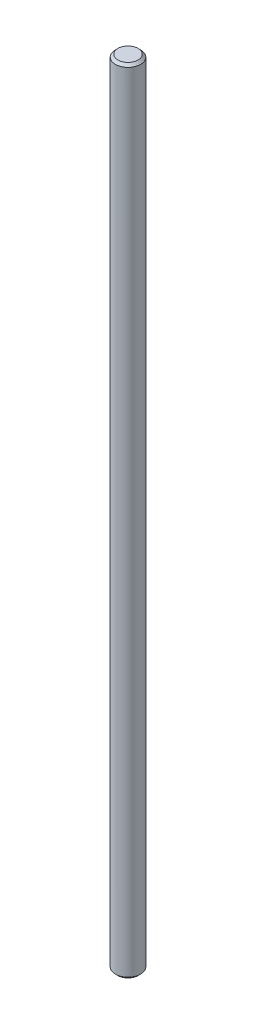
ISO-10303-21;
HEADER;
FILE_DESCRIPTION(('STEP AP214'),'2;1');
FILE_NAME('part.step','',(''),(''),'','','');
FILE_SCHEMA(('AUTOMOTIVE_DESIGN { 1 0 10303 214 1 1 1 1 }'));
ENDSEC;
DATA;
#1=APPLICATION_CONTEXT('core data for automotive mechanical design processes');
#2=APPLICATION_PROTOCOL_DEFINITION('international standard','automotive_design',2000,#1);
#3=PRODUCT_CONTEXT('',#1,'mechanical');
#4=PRODUCT('Part','Part','',(#3));
#5=PRODUCT_RELATED_PRODUCT_CATEGORY('part','',(#4));
#6=PRODUCT_DEFINITION_FORMATION('','',#4);
#7=PRODUCT_DEFINITION_CONTEXT('part definition',#1,'design');
#8=PRODUCT_DEFINITION('design','',#6,#7);
#9=PRODUCT_DEFINITION_SHAPE('','',#8);
#10=(LENGTH_UNIT() NAMED_UNIT(*) SI_UNIT(.MILLI.,.METRE.));
#11=(NAMED_UNIT(*) PLANE_ANGLE_UNIT() SI_UNIT($,.RADIAN.));
#12=(NAMED_UNIT(*) SI_UNIT($,.STERADIAN.) SOLID_ANGLE_UNIT());
#13=UNCERTAINTY_MEASURE_WITH_UNIT(LENGTH_MEASURE(1.E-05),#10,'distance_accuracy_value','');
#14=(GEOMETRIC_REPRESENTATION_CONTEXT(3) GLOBAL_UNCERTAINTY_ASSIGNED_CONTEXT((#13)) GLOBAL_UNIT_ASSIGNED_CONTEXT((#10,
#11,#12)) REPRESENTATION_CONTEXT('',''));
#15=CARTESIAN_POINT('',(0.,0.,0.));
#16=DIRECTION('',(0.,0.,1.));
#17=DIRECTION('',(1.,0.,0.));
#18=AXIS2_PLACEMENT_3D('',#15,#16,#17);
#19=CARTESIAN_POINT('',(0.,126.,0.));
#20=DIRECTION('',(0.,-1.,0.));
#21=DIRECTION('',(0.,0.,-1.));
#22=AXIS2_PLACEMENT_3D('',#19,#20,#21);
#23=CYLINDRICAL_SURFACE('',#22,2.);
#24=CARTESIAN_POINT('',(0.,0.399999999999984,0.));
#25=DIRECTION('',(0.,1.,0.));
#26=DIRECTION('',(0.,0.,1.));
#27=AXIS2_PLACEMENT_3D('',#24,#25,#26);
#28=CIRCLE('',#27,2.);
#29=CARTESIAN_POINT('',(0.,0.399999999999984,2.));
#30=VERTEX_POINT('',#29);
#31=EDGE_CURVE('E39',#30,#30,#28,.T.);
#32=ORIENTED_EDGE('',*,*,#31,.T.);
#33=EDGE_LOOP('',(#32));
#34=FACE_BOUND('',#33,.T.);
#35=CARTESIAN_POINT('',(0.,125.6,0.));
#36=DIRECTION('',(0.,1.,0.));
#37=DIRECTION('',(0.,0.,1.));
#38=AXIS2_PLACEMENT_3D('',#35,#36,#37);
#39=CIRCLE('',#38,2.);
#40=CARTESIAN_POINT('',(0.,125.6,-2.00000000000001));
#41=VERTEX_POINT('',#40);
#42=EDGE_CURVE('E43',#41,#41,#39,.F.);
#43=ORIENTED_EDGE('',*,*,#42,.T.);
#44=EDGE_LOOP('',(#43));
#45=FACE_BOUND('',#44,.T.);
#46=ADVANCED_FACE('F28',(#34,#45),#23,.T.);
#47=CARTESIAN_POINT('',(0.,126.,0.));
#48=DIRECTION('',(0.,1.,0.));
#49=DIRECTION('',(0.,0.,1.));
#50=AXIS2_PLACEMENT_3D('',#47,#48,#49);
#51=PLANE('',#50);
#52=CARTESIAN_POINT('',(0.,126.,0.));
#53=DIRECTION('',(0.,1.,0.));
#54=DIRECTION('',(0.,0.,1.));
#55=AXIS2_PLACEMENT_3D('',#52,#53,#54);
#56=CIRCLE('',#55,1.60000000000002);
#57=CARTESIAN_POINT('',(0.,126.,-1.60000000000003));
#58=VERTEX_POINT('',#57);
#59=EDGE_CURVE('E10',#58,#58,#56,.T.);
#60=ORIENTED_EDGE('',*,*,#59,.T.);
#61=EDGE_LOOP('',(#60));
#62=FACE_BOUND('',#61,.T.);
#63=ADVANCED_FACE('F59',(#62),#51,.T.);
#64=CARTESIAN_POINT('',(0.,0.,0.));
#65=DIRECTION('',(0.,1.,0.));
#66=DIRECTION('',(0.,0.,1.));
#67=AXIS2_PLACEMENT_3D('',#64,#65,#66);
#68=PLANE('',#67);
#69=CARTESIAN_POINT('',(0.,0.,0.));
#70=DIRECTION('',(0.,1.,0.));
#71=DIRECTION('',(0.,0.,1.));
#72=AXIS2_PLACEMENT_3D('',#69,#70,#71);
#73=CIRCLE('',#72,1.60000000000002);
#74=CARTESIAN_POINT('',(0.,0.,1.60000000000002));
#75=VERTEX_POINT('',#74);
#76=EDGE_CURVE('E35',#75,#75,#73,.F.);
#77=ORIENTED_EDGE('',*,*,#76,.T.);
#78=EDGE_LOOP('',(#77));
#79=FACE_BOUND('',#78,.T.);
#80=ADVANCED_FACE('F56',(#79),#68,.F.);
#81=CARTESIAN_POINT('',(0.,0.399999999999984,0.));
#82=DIRECTION('',(0.,1.,0.));
#83=DIRECTION('',(0.,0.,1.));
#84=AXIS2_PLACEMENT_3D('',#81,#82,#83);
#85=CONICAL_SURFACE('',#84,2.,0.785398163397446);
#86=ORIENTED_EDGE('',*,*,#76,.F.);
#87=EDGE_LOOP('',(#86));
#88=FACE_BOUND('',#87,.T.);
#89=ORIENTED_EDGE('',*,*,#31,.F.);
#90=EDGE_LOOP('',(#89));
#91=FACE_BOUND('',#90,.T.);
#92=ADVANCED_FACE('F52',(#88,#91),#85,.T.);
#93=CARTESIAN_POINT('',(0.,126.,0.));
#94=DIRECTION('',(0.,-1.,0.));
#95=DIRECTION('',(0.,0.,-1.));
#96=AXIS2_PLACEMENT_3D('',#93,#94,#95);
#97=CONICAL_SURFACE('',#96,1.60000000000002,0.785398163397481);
#98=CARTESIAN_POINT('',(0.,125.6,-2.00000000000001));
#99=CARTESIAN_POINT('',(0.,125.604166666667,-1.99583333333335));
#100=CARTESIAN_POINT('',(0.,125.608333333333,-1.99166666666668));
#101=CARTESIAN_POINT('',(0.,125.616666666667,-1.98333333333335));
#102=CARTESIAN_POINT('',(0.,125.620833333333,-1.97916666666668));
#103=CARTESIAN_POINT('',(0.,125.629166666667,-1.97083333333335));
#104=CARTESIAN_POINT('',(0.,125.633333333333,-1.96666666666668));
#105=CARTESIAN_POINT('',(0.,125.641666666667,-1.95833333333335));
#106=CARTESIAN_POINT('',(0.,125.645833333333,-1.95416666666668));
#107=CARTESIAN_POINT('',(0.,125.654166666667,-1.94583333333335));
#108=CARTESIAN_POINT('',(0.,125.658333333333,-1.94166666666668));
#109=CARTESIAN_POINT('',(0.,125.666666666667,-1.93333333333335));
#110=CARTESIAN_POINT('',(0.,125.670833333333,-1.92916666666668));
#111=CARTESIAN_POINT('',(0.,125.679166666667,-1.92083333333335));
#112=CARTESIAN_POINT('',(0.,125.683333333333,-1.91666666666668));
#113=CARTESIAN_POINT('',(0.,125.691666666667,-1.90833333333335));
#114=CARTESIAN_POINT('',(0.,125.695833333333,-1.90416666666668));
#115=CARTESIAN_POINT('',(0.,125.704166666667,-1.89583333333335));
#116=CARTESIAN_POINT('',(0.,125.708333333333,-1.89166666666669));
#117=CARTESIAN_POINT('',(0.,125.716666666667,-1.88333333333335));
#118=CARTESIAN_POINT('',(0.,125.720833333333,-1.87916666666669));
#119=CARTESIAN_POINT('',(0.,125.729166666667,-1.87083333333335));
#120=CARTESIAN_POINT('',(0.,125.733333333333,-1.86666666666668));
#121=CARTESIAN_POINT('',(0.,125.741666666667,-1.85833333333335));
#122=CARTESIAN_POINT('',(0.,125.745833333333,-1.85416666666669));
#123=CARTESIAN_POINT('',(0.,125.754166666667,-1.84583333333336));
#124=CARTESIAN_POINT('',(0.,125.758333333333,-1.84166666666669));
#125=CARTESIAN_POINT('',(0.,125.766666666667,-1.83333333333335));
#126=CARTESIAN_POINT('',(0.,125.770833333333,-1.82916666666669));
#127=CARTESIAN_POINT('',(0.,125.779166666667,-1.82083333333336));
#128=CARTESIAN_POINT('',(0.,125.783333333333,-1.81666666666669));
#129=CARTESIAN_POINT('',(0.,125.791666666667,-1.80833333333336));
#130=CARTESIAN_POINT('',(0.,125.795833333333,-1.80416666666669));
#131=CARTESIAN_POINT('',(0.,125.804166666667,-1.79583333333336));
#132=CARTESIAN_POINT('',(0.,125.808333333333,-1.79166666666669));
#133=CARTESIAN_POINT('',(0.,125.816666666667,-1.78333333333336));
#134=CARTESIAN_POINT('',(0.,125.820833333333,-1.77916666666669));
#135=CARTESIAN_POINT('',(0.,125.829166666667,-1.77083333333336));
#136=CARTESIAN_POINT('',(0.,125.833333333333,-1.76666666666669));
#137=CARTESIAN_POINT('',(0.,125.841666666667,-1.75833333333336));
#138=CARTESIAN_POINT('',(0.,125.845833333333,-1.75416666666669));
#139=CARTESIAN_POINT('',(0.,125.854166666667,-1.74583333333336));
#140=CARTESIAN_POINT('',(0.,125.858333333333,-1.74166666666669));
#141=CARTESIAN_POINT('',(0.,125.866666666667,-1.73333333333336));
#142=CARTESIAN_POINT('',(0.,125.870833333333,-1.72916666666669));
#143=CARTESIAN_POINT('',(0.,125.879166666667,-1.72083333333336));
#144=CARTESIAN_POINT('',(0.,125.883333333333,-1.71666666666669));
#145=CARTESIAN_POINT('',(0.,125.891666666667,-1.70833333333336));
#146=CARTESIAN_POINT('',(0.,125.895833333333,-1.7041666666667));
#147=CARTESIAN_POINT('',(0.,125.904166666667,-1.69583333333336));
#148=CARTESIAN_POINT('',(0.,125.908333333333,-1.6916666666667));
#149=CARTESIAN_POINT('',(0.,125.916666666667,-1.68333333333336));
#150=CARTESIAN_POINT('',(0.,125.920833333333,-1.67916666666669));
#151=CARTESIAN_POINT('',(0.,125.929166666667,-1.67083333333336));
#152=CARTESIAN_POINT('',(0.,125.933333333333,-1.6666666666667));
#153=CARTESIAN_POINT('',(0.,125.941666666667,-1.65833333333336));
#154=CARTESIAN_POINT('',(0.,125.945833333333,-1.6541666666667));
#155=CARTESIAN_POINT('',(0.,125.954166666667,-1.64583333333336));
#156=CARTESIAN_POINT('',(0.,125.958333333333,-1.6416666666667));
#157=CARTESIAN_POINT('',(0.,125.966666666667,-1.63333333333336));
#158=CARTESIAN_POINT('',(0.,125.970833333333,-1.6291666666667));
#159=CARTESIAN_POINT('',(0.,125.979166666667,-1.62083333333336));
#160=CARTESIAN_POINT('',(0.,125.983333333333,-1.6166666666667));
#161=CARTESIAN_POINT('',(0.,125.991666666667,-1.60833333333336));
#162=CARTESIAN_POINT('',(0.,125.995833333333,-1.6041666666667));
#163=CARTESIAN_POINT('',(0.,126.,-1.60000000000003));
#164=B_SPLINE_CURVE_WITH_KNOTS('',3,(#98,#99,#100,#101,#102,#103,#104,#105,#106,#107,#108,#109,
#110,#111,#112,#113,#114,#115,#116,#117,#118,#119,#120,#121,#122,#123,#124,#125,#126,#127,#128,
#129,#130,#131,#132,#133,#134,#135,#136,#137,#138,#139,#140,#141,#142,#143,#144,#145,#146,#147,
#148,#149,#150,#151,#152,#153,#154,#155,#156,#157,#158,#159,#160,#161,#162,#163),.UNSPECIFIED.,
.F.,.F.,(4,2,2,2,2,2,2,2,2,2,2,2,2,2,2,2,2,2,2,2,2,2,2,2,2,2,2,2,2,2,2,2,4),(0.,
0.0176776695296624,0.0353553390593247,0.0530330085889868,0.0707106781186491,0.0883883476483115,
0.106066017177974,0.123743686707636,0.141421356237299,0.159099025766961,0.176776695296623,
0.194454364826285,0.212132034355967,0.22980970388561,0.247487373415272,0.265165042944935,
0.282842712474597,0.300520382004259,0.318198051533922,0.335875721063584,0.353553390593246,
0.371231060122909,0.388908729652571,0.406586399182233,0.424264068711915,0.441941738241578,
0.45961940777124,0.477297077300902,0.494974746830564,0.512652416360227,0.530330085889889,
0.548007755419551,0.565685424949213),.UNSPECIFIED.);
#165=EDGE_CURVE('BSEAM30',#41,#58,#164,.T.);
#166=ORIENTED_EDGE('',*,*,#42,.F.);
#167=ORIENTED_EDGE('',*,*,#59,.F.);
#168=ORIENTED_EDGE('',*,*,#165,.T.);
#169=ORIENTED_EDGE('',*,*,#165,.F.);
#170=EDGE_LOOP('',(#166,#168,#167,#169));
#171=FACE_BOUND('',#170,.T.);
#172=ADVANCED_FACE('F30',(#171),#97,.T.);
#173=CLOSED_SHELL('',(#46,#63,#80,#92,#172));
#174=MANIFOLD_SOLID_BREP('B2',#173);
#175=ADVANCED_BREP_SHAPE_REPRESENTATION('',(#18,#174),#14);
#176=SHAPE_DEFINITION_REPRESENTATION(#9,#175);
ENDSEC;
END-ISO-10303-21;
